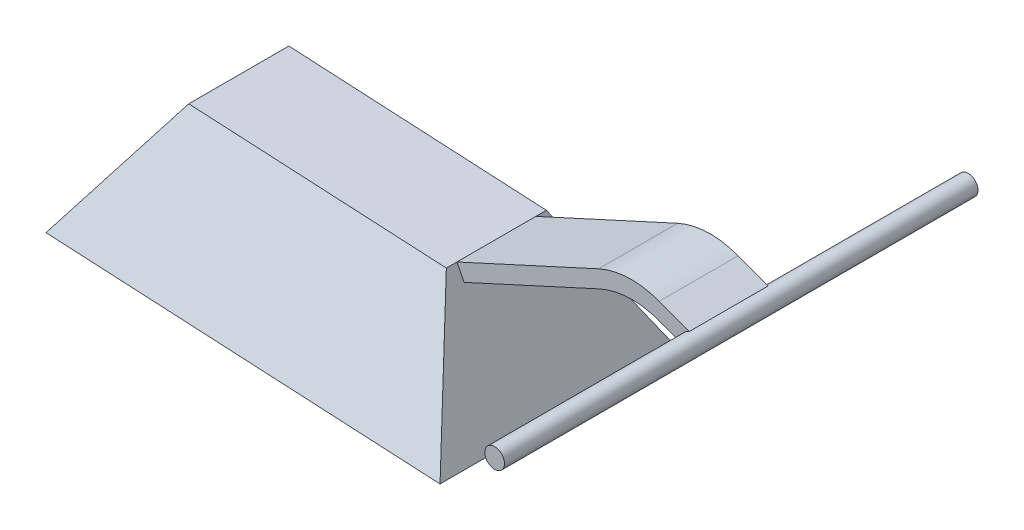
from build123d import *

# Parameters (mm, degrees)
SKETCH_1_W        = 50
SKETCH_1_H        = 30
EXTRUDE_1_DEPTH   = 15
EXTRUDE_1_DRAFT   = -30
SKETCH_2_R        = 1.25
EXTRUDE_2_DEPTH   = 30
EXTRUDE_1_2_DEPTH = 5
FILLET_1_R        = 10


with BuildPart() as part:
    # Sketch 1 → Extrude 1 (with draft: the straight prism first)
    with BuildSketch(Plane(origin=(85.941069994, -2.250446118, 0), x_dir=(-0.9986295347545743, 0.052335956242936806, 0), z_dir=(-0.05233595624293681, -0.9986295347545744, 0))):
        with Locations((85.941069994, 0)):
            Rectangle(SKETCH_1_W, SKETCH_1_H)
    extrude(amount=-EXTRUDE_1_DEPTH)
    # Extrude 1: the draft: its side faces are tilted about the plane it starts from
    extrude_1_sides = [part.faces().sort_by_distance(p)[0] for p in [
        (0.510298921, 9.737083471, 15),
        (-24.455439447, 11.045482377, 0),
        (0.510298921, 9.737083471, -15),
        (25.47603729, 8.428684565, 0),
    ]]
    draft(extrude_1_sides, Plane(origin=(85.941069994, -2.250446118, 0), x_dir=(-0.9986295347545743, 0.052335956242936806, 0), z_dir=(-0.05233595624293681, -0.9986295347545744, 0)), EXTRUDE_1_DRAFT)


with BuildPart() as body_2:
    # Sketch 2 → Extrude 2 (new, symmetric)
    with BuildSketch(Plane.XY):
        with Locations((47, 22.25)):
            Circle(SKETCH_2_R)
    extrude(amount=EXTRUDE_2_DEPTH, both=True)

    # Sketch 3 → Extrude 1 2 (add, symmetric)
    with BuildSketch(Plane.XY):
        Polygon((16.526408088, 13.85389938), (39.038351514, 24.167617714), (46.648876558, 21.313670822), (47.351123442, 23.186329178), (38.961648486, 26.332382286), (15.693382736, 15.672159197), align=None)
    extrude(amount=EXTRUDE_1_2_DEPTH, both=True)

    # Fillet 1
    fillet_1_edges = [body_2.edges().sort_by_distance(p)[0] for p in [
        (38.961648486, 26.332382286, 0),
        (39.038351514, 24.167617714, 0),
    ]]
    fillet(fillet_1_edges, radius=FILLET_1_R)


solid = Compound([part.part, body_2.part])
